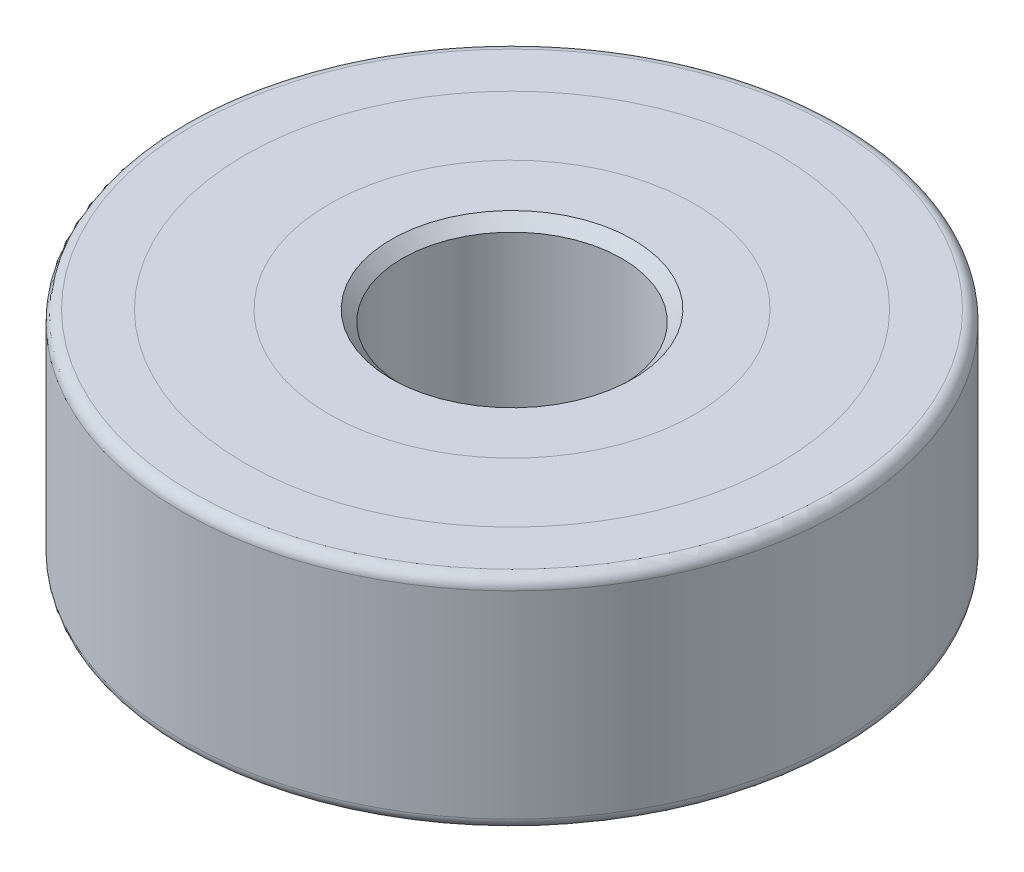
ISO-10303-21;
HEADER;
FILE_DESCRIPTION(('STEP AP214'),'2;1');
FILE_NAME('part.step','',(''),(''),'','','');
FILE_SCHEMA(('AUTOMOTIVE_DESIGN { 1 0 10303 214 1 1 1 1 }'));
ENDSEC;
DATA;
#1=APPLICATION_CONTEXT('core data for automotive mechanical design processes');
#2=APPLICATION_PROTOCOL_DEFINITION('international standard','automotive_design',2000,#1);
#3=PRODUCT_CONTEXT('',#1,'mechanical');
#4=PRODUCT('Part','Part','',(#3));
#5=PRODUCT_RELATED_PRODUCT_CATEGORY('part','',(#4));
#6=PRODUCT_DEFINITION_FORMATION('','',#4);
#7=PRODUCT_DEFINITION_CONTEXT('part definition',#1,'design');
#8=PRODUCT_DEFINITION('design','',#6,#7);
#9=PRODUCT_DEFINITION_SHAPE('','',#8);
#10=(LENGTH_UNIT() NAMED_UNIT(*) SI_UNIT(.MILLI.,.METRE.));
#11=(NAMED_UNIT(*) PLANE_ANGLE_UNIT() SI_UNIT($,.RADIAN.));
#12=(NAMED_UNIT(*) SI_UNIT($,.STERADIAN.) SOLID_ANGLE_UNIT());
#13=UNCERTAINTY_MEASURE_WITH_UNIT(LENGTH_MEASURE(1.E-05),#10,'distance_accuracy_value','');
#14=(GEOMETRIC_REPRESENTATION_CONTEXT(3) GLOBAL_UNCERTAINTY_ASSIGNED_CONTEXT((#13)) GLOBAL_UNIT_ASSIGNED_CONTEXT((#10,
#11,#12)) REPRESENTATION_CONTEXT('',''));
#15=CARTESIAN_POINT('',(0.,0.,0.));
#16=DIRECTION('',(0.,0.,1.));
#17=DIRECTION('',(1.,0.,0.));
#18=AXIS2_PLACEMENT_3D('',#15,#16,#17);
#19=CARTESIAN_POINT('',(0.,-0.00999999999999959,0.));
#20=DIRECTION('',(0.,1.,0.));
#21=DIRECTION('',(0.,0.,1.));
#22=AXIS2_PLACEMENT_3D('',#19,#20,#21);
#23=CYLINDRICAL_SURFACE('',#22,8.3062521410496);
#24=CARTESIAN_POINT('',(0.,0.,0.));
#25=DIRECTION('',(0.,1.,0.));
#26=DIRECTION('',(0.,0.,1.));
#27=AXIS2_PLACEMENT_3D('',#24,#25,#26);
#28=CIRCLE('',#27,8.3062521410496);
#29=CARTESIAN_POINT('',(0.,0.,8.3062521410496));
#30=VERTEX_POINT('',#29);
#31=EDGE_CURVE('E67',#30,#30,#28,.T.);
#32=ORIENTED_EDGE('',*,*,#31,.T.);
#33=EDGE_LOOP('',(#32));
#34=FACE_BOUND('',#33,.T.);
#35=CARTESIAN_POINT('',(0.,10.,0.));
#36=DIRECTION('',(0.,1.,0.));
#37=DIRECTION('',(0.,0.,1.));
#38=AXIS2_PLACEMENT_3D('',#35,#36,#37);
#39=CIRCLE('',#38,8.3062521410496);
#40=CARTESIAN_POINT('',(0.,10.,8.3062521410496));
#41=VERTEX_POINT('',#40);
#42=EDGE_CURVE('E64',#41,#41,#39,.T.);
#43=ORIENTED_EDGE('',*,*,#42,.F.);
#44=EDGE_LOOP('',(#43));
#45=FACE_BOUND('',#44,.T.);
#46=ADVANCED_FACE('F44',(#34,#45),#23,.T.);
#47=CARTESIAN_POINT('',(0.,10.,0.));
#48=DIRECTION('',(0.,-1.,0.));
#49=DIRECTION('',(0.,0.,-1.));
#50=AXIS2_PLACEMENT_3D('',#47,#48,#49);
#51=CYLINDRICAL_SURFACE('',#50,5.);
#52=CARTESIAN_POINT('',(0.,0.500000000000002,0.));
#53=DIRECTION('',(0.,1.,0.));
#54=DIRECTION('',(0.,0.,1.));
#55=AXIS2_PLACEMENT_3D('',#52,#53,#54);
#56=CIRCLE('',#55,5.);
#57=CARTESIAN_POINT('',(0.,0.500000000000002,5.));
#58=VERTEX_POINT('',#57);
#59=EDGE_CURVE('E51',#58,#58,#56,.F.);
#60=ORIENTED_EDGE('',*,*,#59,.T.);
#61=EDGE_LOOP('',(#60));
#62=FACE_BOUND('',#61,.T.);
#63=CARTESIAN_POINT('',(0.,9.5,0.));
#64=DIRECTION('',(0.,1.,0.));
#65=DIRECTION('',(0.,0.,1.));
#66=AXIS2_PLACEMENT_3D('',#63,#64,#65);
#67=CIRCLE('',#66,5.);
#68=CARTESIAN_POINT('',(0.,9.5,5.));
#69=VERTEX_POINT('',#68);
#70=EDGE_CURVE('E55',#69,#69,#67,.T.);
#71=ORIENTED_EDGE('',*,*,#70,.T.);
#72=EDGE_LOOP('',(#71));
#73=FACE_BOUND('',#72,.T.);
#74=ADVANCED_FACE('F76',(#62,#73),#51,.F.);
#75=CARTESIAN_POINT('',(0.,0.,0.));
#76=DIRECTION('',(0.,1.,0.));
#77=DIRECTION('',(0.,0.,1.));
#78=AXIS2_PLACEMENT_3D('',#75,#76,#77);
#79=PLANE('',#78);
#80=CARTESIAN_POINT('',(0.,0.,0.));
#81=DIRECTION('',(0.,1.,0.));
#82=DIRECTION('',(0.,0.,1.));
#83=AXIS2_PLACEMENT_3D('',#80,#81,#82);
#84=CIRCLE('',#83,5.5);
#85=CARTESIAN_POINT('',(0.,0.,5.5));
#86=VERTEX_POINT('',#85);
#87=EDGE_CURVE('E59',#86,#86,#84,.T.);
#88=ORIENTED_EDGE('',*,*,#87,.T.);
#89=EDGE_LOOP('',(#88));
#90=FACE_BOUND('',#89,.T.);
#91=ORIENTED_EDGE('',*,*,#31,.F.);
#92=EDGE_LOOP('',(#91));
#93=FACE_BOUND('',#92,.T.);
#94=ADVANCED_FACE('F73',(#90,#93),#79,.F.);
#95=CARTESIAN_POINT('',(0.,10.,0.));
#96=DIRECTION('',(0.,1.,0.));
#97=DIRECTION('',(0.,0.,1.));
#98=AXIS2_PLACEMENT_3D('',#95,#96,#97);
#99=PLANE('',#98);
#100=CARTESIAN_POINT('',(0.,10.,0.));
#101=DIRECTION('',(0.,1.,0.));
#102=DIRECTION('',(0.,0.,1.));
#103=AXIS2_PLACEMENT_3D('',#100,#101,#102);
#104=CIRCLE('',#103,5.50000000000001);
#105=CARTESIAN_POINT('',(0.,10.,5.50000000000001));
#106=VERTEX_POINT('',#105);
#107=EDGE_CURVE('E11',#106,#106,#104,.F.);
#108=ORIENTED_EDGE('',*,*,#107,.T.);
#109=EDGE_LOOP('',(#108));
#110=FACE_BOUND('',#109,.T.);
#111=ORIENTED_EDGE('',*,*,#42,.T.);
#112=EDGE_LOOP('',(#111));
#113=FACE_BOUND('',#112,.T.);
#114=ADVANCED_FACE('F75',(#110,#113),#99,.T.);
#115=CARTESIAN_POINT('',(0.,0.,0.));
#116=DIRECTION('',(0.,-1.,0.));
#117=DIRECTION('',(0.,0.,-1.));
#118=AXIS2_PLACEMENT_3D('',#115,#116,#117);
#119=CONICAL_SURFACE('',#118,5.5,0.785398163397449);
#120=ORIENTED_EDGE('',*,*,#59,.F.);
#121=EDGE_LOOP('',(#120));
#122=FACE_BOUND('',#121,.T.);
#123=ORIENTED_EDGE('',*,*,#87,.F.);
#124=EDGE_LOOP('',(#123));
#125=FACE_BOUND('',#124,.T.);
#126=ADVANCED_FACE('F83',(#122,#125),#119,.F.);
#127=CARTESIAN_POINT('',(0.,9.5,0.));
#128=DIRECTION('',(0.,1.,0.));
#129=DIRECTION('',(0.,0.,1.));
#130=AXIS2_PLACEMENT_3D('',#127,#128,#129);
#131=CONICAL_SURFACE('',#130,5.,0.785398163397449);
#132=ORIENTED_EDGE('',*,*,#107,.F.);
#133=EDGE_LOOP('',(#132));
#134=FACE_BOUND('',#133,.T.);
#135=ORIENTED_EDGE('',*,*,#70,.F.);
#136=EDGE_LOOP('',(#135));
#137=FACE_BOUND('',#136,.T.);
#138=ADVANCED_FACE('F46',(#134,#137),#131,.F.);
#139=CLOSED_SHELL('',(#46,#74,#94,#114,#126,#138));
#140=MANIFOLD_SOLID_BREP('B2',#139);
#141=CARTESIAN_POINT('',(0.,-0.00999999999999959,0.));
#142=DIRECTION('',(0.,1.,0.));
#143=DIRECTION('',(0.,0.,1.));
#144=AXIS2_PLACEMENT_3D('',#141,#142,#143);
#145=CYLINDRICAL_SURFACE('',#144,12.1519604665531);
#146=CARTESIAN_POINT('',(0.,10.,0.));
#147=DIRECTION('',(0.,1.,0.));
#148=DIRECTION('',(0.,0.,1.));
#149=AXIS2_PLACEMENT_3D('',#146,#147,#148);
#150=CIRCLE('',#149,12.1519604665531);
#151=CARTESIAN_POINT('',(0.,10.,12.1519604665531));
#152=VERTEX_POINT('',#151);
#153=EDGE_CURVE('E163',#152,#152,#150,.T.);
#154=ORIENTED_EDGE('',*,*,#153,.T.);
#155=EDGE_LOOP('',(#154));
#156=FACE_BOUND('',#155,.T.);
#157=CARTESIAN_POINT('',(0.,0.,0.));
#158=DIRECTION('',(0.,1.,0.));
#159=DIRECTION('',(0.,0.,1.));
#160=AXIS2_PLACEMENT_3D('',#157,#158,#159);
#161=CIRCLE('',#160,12.1519604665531);
#162=CARTESIAN_POINT('',(0.,0.,12.1519604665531));
#163=VERTEX_POINT('',#162);
#164=EDGE_CURVE('E166',#163,#163,#161,.T.);
#165=ORIENTED_EDGE('',*,*,#164,.F.);
#166=EDGE_LOOP('',(#165));
#167=FACE_BOUND('',#166,.T.);
#168=ADVANCED_FACE('F143',(#156,#167),#145,.F.);
#169=CARTESIAN_POINT('',(0.,10.,0.));
#170=DIRECTION('',(0.,-1.,0.));
#171=DIRECTION('',(0.,0.,-1.));
#172=AXIS2_PLACEMENT_3D('',#169,#170,#171);
#173=CYLINDRICAL_SURFACE('',#172,15.);
#174=CARTESIAN_POINT('',(0.,0.5,0.));
#175=DIRECTION('',(0.,1.,0.));
#176=DIRECTION('',(0.,0.,1.));
#177=AXIS2_PLACEMENT_3D('',#174,#175,#176);
#178=CIRCLE('',#177,15.);
#179=CARTESIAN_POINT('',(0.,0.5,15.));
#180=VERTEX_POINT('',#179);
#181=EDGE_CURVE('E154',#180,#180,#178,.T.);
#182=ORIENTED_EDGE('',*,*,#181,.T.);
#183=EDGE_LOOP('',(#182));
#184=FACE_BOUND('',#183,.T.);
#185=CARTESIAN_POINT('',(0.,9.5,0.));
#186=DIRECTION('',(0.,1.,0.));
#187=DIRECTION('',(0.,0.,1.));
#188=AXIS2_PLACEMENT_3D('',#185,#186,#187);
#189=CIRCLE('',#188,15.);
#190=CARTESIAN_POINT('',(0.,9.5,15.));
#191=VERTEX_POINT('',#190);
#192=EDGE_CURVE('E158',#191,#191,#189,.F.);
#193=ORIENTED_EDGE('',*,*,#192,.T.);
#194=EDGE_LOOP('',(#193));
#195=FACE_BOUND('',#194,.T.);
#196=ADVANCED_FACE('F173',(#184,#195),#173,.T.);
#197=CARTESIAN_POINT('',(0.,0.,0.));
#198=DIRECTION('',(0.,1.,0.));
#199=DIRECTION('',(0.,0.,1.));
#200=AXIS2_PLACEMENT_3D('',#197,#198,#199);
#201=PLANE('',#200);
#202=CARTESIAN_POINT('',(0.,0.,0.));
#203=DIRECTION('',(0.,1.,0.));
#204=DIRECTION('',(0.,0.,1.));
#205=AXIS2_PLACEMENT_3D('',#202,#203,#204);
#206=CIRCLE('',#205,14.5);
#207=CARTESIAN_POINT('',(0.,0.,14.5));
#208=VERTEX_POINT('',#207);
#209=EDGE_CURVE('E150',#208,#208,#206,.F.);
#210=ORIENTED_EDGE('',*,*,#209,.T.);
#211=EDGE_LOOP('',(#210));
#212=FACE_BOUND('',#211,.T.);
#213=ORIENTED_EDGE('',*,*,#164,.T.);
#214=EDGE_LOOP('',(#213));
#215=FACE_BOUND('',#214,.T.);
#216=ADVANCED_FACE('F170',(#212,#215),#201,.F.);
#217=CARTESIAN_POINT('',(0.,10.,0.));
#218=DIRECTION('',(0.,1.,0.));
#219=DIRECTION('',(0.,0.,1.));
#220=AXIS2_PLACEMENT_3D('',#217,#218,#219);
#221=PLANE('',#220);
#222=CARTESIAN_POINT('',(0.,10.,0.));
#223=DIRECTION('',(0.,1.,0.));
#224=DIRECTION('',(0.,0.,1.));
#225=AXIS2_PLACEMENT_3D('',#222,#223,#224);
#226=CIRCLE('',#225,14.5);
#227=CARTESIAN_POINT('',(0.,10.,14.5));
#228=VERTEX_POINT('',#227);
#229=EDGE_CURVE('E43',#228,#228,#226,.T.);
#230=ORIENTED_EDGE('',*,*,#229,.T.);
#231=EDGE_LOOP('',(#230));
#232=FACE_BOUND('',#231,.T.);
#233=ORIENTED_EDGE('',*,*,#153,.F.);
#234=EDGE_LOOP('',(#233));
#235=FACE_BOUND('',#234,.T.);
#236=ADVANCED_FACE('F184',(#232,#235),#221,.T.);
#237=CARTESIAN_POINT('',(0.,0.5,0.));
#238=DIRECTION('',(0.,1.,0.));
#239=DIRECTION('',(0.,0.,1.));
#240=AXIS2_PLACEMENT_3D('',#237,#238,#239);
#241=TOROIDAL_SURFACE('',#240,14.5,0.5);
#242=ORIENTED_EDGE('',*,*,#209,.F.);
#243=EDGE_LOOP('',(#242));
#244=FACE_BOUND('',#243,.T.);
#245=ORIENTED_EDGE('',*,*,#181,.F.);
#246=EDGE_LOOP('',(#245));
#247=FACE_BOUND('',#246,.T.);
#248=ADVANCED_FACE('F182',(#244,#247),#241,.T.);
#249=CARTESIAN_POINT('',(0.,9.5,0.));
#250=DIRECTION('',(0.,1.,0.));
#251=DIRECTION('',(0.,0.,1.));
#252=AXIS2_PLACEMENT_3D('',#249,#250,#251);
#253=TOROIDAL_SURFACE('',#252,14.5,0.5);
#254=ORIENTED_EDGE('',*,*,#192,.F.);
#255=EDGE_LOOP('',(#254));
#256=FACE_BOUND('',#255,.T.);
#257=ORIENTED_EDGE('',*,*,#229,.F.);
#258=EDGE_LOOP('',(#257));
#259=FACE_BOUND('',#258,.T.);
#260=ADVANCED_FACE('F145',(#256,#259),#253,.T.);
#261=CLOSED_SHELL('',(#168,#196,#216,#236,#248,#260));
#262=MANIFOLD_SOLID_BREP('B6',#261);
#263=CARTESIAN_POINT('',(0.,-0.00999999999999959,0.));
#264=DIRECTION('',(0.,1.,0.));
#265=DIRECTION('',(0.,0.,1.));
#266=AXIS2_PLACEMENT_3D('',#263,#264,#265);
#267=CYLINDRICAL_SURFACE('',#266,8.3062521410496);
#268=CARTESIAN_POINT('',(0.,10.,0.));
#269=DIRECTION('',(0.,1.,0.));
#270=DIRECTION('',(0.,0.,1.));
#271=AXIS2_PLACEMENT_3D('',#268,#269,#270);
#272=CIRCLE('',#271,8.3062521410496);
#273=CARTESIAN_POINT('',(0.,10.,8.3062521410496));
#274=VERTEX_POINT('',#273);
#275=EDGE_CURVE('E239',#274,#274,#272,.T.);
#276=ORIENTED_EDGE('',*,*,#275,.T.);
#277=EDGE_LOOP('',(#276));
#278=FACE_BOUND('',#277,.T.);
#279=CARTESIAN_POINT('',(0.,0.,0.));
#280=DIRECTION('',(0.,1.,0.));
#281=DIRECTION('',(0.,0.,1.));
#282=AXIS2_PLACEMENT_3D('',#279,#280,#281);
#283=CIRCLE('',#282,8.3062521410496);
#284=CARTESIAN_POINT('',(0.,0.,8.3062521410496));
#285=VERTEX_POINT('',#284);
#286=EDGE_CURVE('E142',#285,#285,#283,.T.);
#287=ORIENTED_EDGE('',*,*,#286,.F.);
#288=EDGE_LOOP('',(#287));
#289=FACE_BOUND('',#288,.T.);
#290=ADVANCED_FACE('F235',(#278,#289),#267,.F.);
#291=CARTESIAN_POINT('',(0.,-0.00999999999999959,0.));
#292=DIRECTION('',(0.,1.,0.));
#293=DIRECTION('',(0.,0.,1.));
#294=AXIS2_PLACEMENT_3D('',#291,#292,#293);
#295=CYLINDRICAL_SURFACE('',#294,12.1519604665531);
#296=CARTESIAN_POINT('',(0.,0.,0.));
#297=DIRECTION('',(0.,1.,0.));
#298=DIRECTION('',(0.,0.,1.));
#299=AXIS2_PLACEMENT_3D('',#296,#297,#298);
#300=CIRCLE('',#299,12.1519604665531);
#301=CARTESIAN_POINT('',(0.,0.,12.1519604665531));
#302=VERTEX_POINT('',#301);
#303=EDGE_CURVE('E249',#302,#302,#300,.T.);
#304=ORIENTED_EDGE('',*,*,#303,.T.);
#305=EDGE_LOOP('',(#304));
#306=FACE_BOUND('',#305,.T.);
#307=CARTESIAN_POINT('',(0.,10.,0.));
#308=DIRECTION('',(0.,1.,0.));
#309=DIRECTION('',(0.,0.,1.));
#310=AXIS2_PLACEMENT_3D('',#307,#308,#309);
#311=CIRCLE('',#310,12.1519604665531);
#312=CARTESIAN_POINT('',(0.,10.,12.1519604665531));
#313=VERTEX_POINT('',#312);
#314=EDGE_CURVE('E243',#313,#313,#311,.T.);
#315=ORIENTED_EDGE('',*,*,#314,.F.);
#316=EDGE_LOOP('',(#315));
#317=FACE_BOUND('',#316,.T.);
#318=ADVANCED_FACE('F261',(#306,#317),#295,.T.);
#319=CARTESIAN_POINT('',(0.,0.,0.));
#320=DIRECTION('',(0.,1.,0.));
#321=DIRECTION('',(0.,0.,1.));
#322=AXIS2_PLACEMENT_3D('',#319,#320,#321);
#323=PLANE('',#322);
#324=ORIENTED_EDGE('',*,*,#286,.T.);
#325=EDGE_LOOP('',(#324));
#326=FACE_BOUND('',#325,.T.);
#327=ORIENTED_EDGE('',*,*,#303,.F.);
#328=EDGE_LOOP('',(#327));
#329=FACE_BOUND('',#328,.T.);
#330=ADVANCED_FACE('F260',(#326,#329),#323,.F.);
#331=CARTESIAN_POINT('',(0.,10.,0.));
#332=DIRECTION('',(0.,1.,0.));
#333=DIRECTION('',(0.,0.,1.));
#334=AXIS2_PLACEMENT_3D('',#331,#332,#333);
#335=PLANE('',#334);
#336=ORIENTED_EDGE('',*,*,#275,.F.);
#337=EDGE_LOOP('',(#336));
#338=FACE_BOUND('',#337,.T.);
#339=ORIENTED_EDGE('',*,*,#314,.T.);
#340=EDGE_LOOP('',(#339));
#341=FACE_BOUND('',#340,.T.);
#342=ADVANCED_FACE('F237',(#338,#341),#335,.T.);
#343=CLOSED_SHELL('',(#290,#318,#330,#342));
#344=MANIFOLD_SOLID_BREP('B38',#343);
#345=ADVANCED_BREP_SHAPE_REPRESENTATION('',(#18,#140,#262,#344),#14);
#346=SHAPE_DEFINITION_REPRESENTATION(#9,#345);
ENDSEC;
END-ISO-10303-21;
